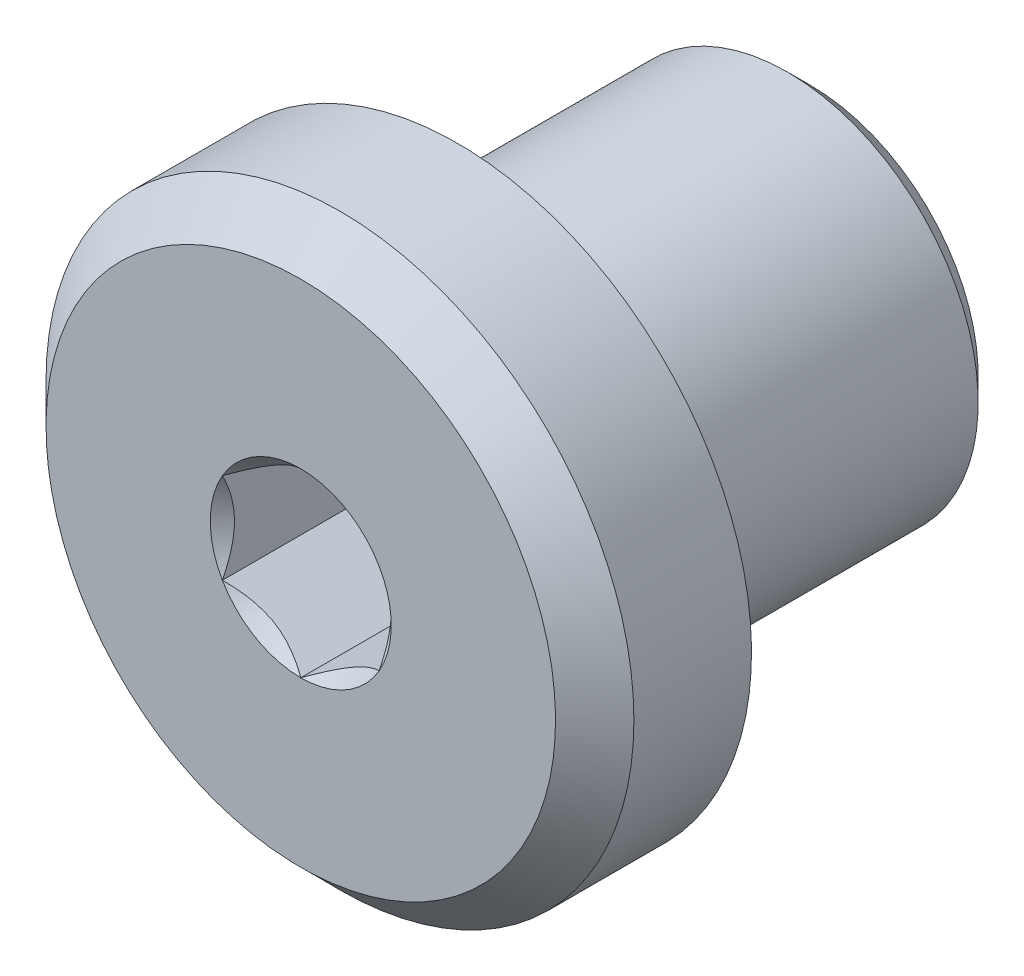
ISO-10303-21;
HEADER;
FILE_DESCRIPTION(('STEP AP214'),'2;1');
FILE_NAME('part.step','',(''),(''),'','','');
FILE_SCHEMA(('AUTOMOTIVE_DESIGN { 1 0 10303 214 1 1 1 1 }'));
ENDSEC;
DATA;
#1=APPLICATION_CONTEXT('core data for automotive mechanical design processes');
#2=APPLICATION_PROTOCOL_DEFINITION('international standard','automotive_design',2000,#1);
#3=PRODUCT_CONTEXT('',#1,'mechanical');
#4=PRODUCT('Part','Part','',(#3));
#5=PRODUCT_RELATED_PRODUCT_CATEGORY('part','',(#4));
#6=PRODUCT_DEFINITION_FORMATION('','',#4);
#7=PRODUCT_DEFINITION_CONTEXT('part definition',#1,'design');
#8=PRODUCT_DEFINITION('design','',#6,#7);
#9=PRODUCT_DEFINITION_SHAPE('','',#8);
#10=(LENGTH_UNIT() NAMED_UNIT(*) SI_UNIT(.MILLI.,.METRE.));
#11=(NAMED_UNIT(*) PLANE_ANGLE_UNIT() SI_UNIT($,.RADIAN.));
#12=(NAMED_UNIT(*) SI_UNIT($,.STERADIAN.) SOLID_ANGLE_UNIT());
#13=UNCERTAINTY_MEASURE_WITH_UNIT(LENGTH_MEASURE(1.E-05),#10,'distance_accuracy_value','');
#14=(GEOMETRIC_REPRESENTATION_CONTEXT(3) GLOBAL_UNCERTAINTY_ASSIGNED_CONTEXT((#13)) GLOBAL_UNIT_ASSIGNED_CONTEXT((#10,
#11,#12)) REPRESENTATION_CONTEXT('',''));
#15=CARTESIAN_POINT('',(0.,0.,0.));
#16=DIRECTION('',(0.,0.,1.));
#17=DIRECTION('',(1.,0.,0.));
#18=AXIS2_PLACEMENT_3D('',#15,#16,#17);
#19=CARTESIAN_POINT('',(0.,0.,-1.));
#20=DIRECTION('',(0.,0.,1.));
#21=DIRECTION('',(0.,-1.,0.));
#22=AXIS2_PLACEMENT_3D('',#19,#20,#21);
#23=PLANE('',#22);
#24=DIRECTION('',(-0.866025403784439,0.5,0.));
#25=VECTOR('',#24,1.);
#26=CARTESIAN_POINT('',(2.,1.15470053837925,-1.));
#27=LINE('',#26,#25);
#28=CARTESIAN_POINT('',(2.,1.15470053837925,-1.));
#29=VERTEX_POINT('',#28);
#30=CARTESIAN_POINT('',(0.,2.3094010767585,-1.));
#31=VERTEX_POINT('',#30);
#32=EDGE_CURVE('E64',#29,#31,#27,.T.);
#33=ORIENTED_EDGE('',*,*,#32,.T.);
#34=DIRECTION('',(-0.866025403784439,-0.5,0.));
#35=VECTOR('',#34,1.);
#36=CARTESIAN_POINT('',(0.,2.3094010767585,-1.));
#37=LINE('',#36,#35);
#38=CARTESIAN_POINT('',(-2.,1.15470053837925,-1.));
#39=VERTEX_POINT('',#38);
#40=EDGE_CURVE('E78',#31,#39,#37,.T.);
#41=ORIENTED_EDGE('',*,*,#40,.T.);
#42=DIRECTION('',(0.,-1.,0.));
#43=VECTOR('',#42,1.);
#44=CARTESIAN_POINT('',(-2.,1.15470053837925,-1.));
#45=LINE('',#44,#43);
#46=CARTESIAN_POINT('',(-2.,-1.15470053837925,-1.));
#47=VERTEX_POINT('',#46);
#48=EDGE_CURVE('E81',#39,#47,#45,.T.);
#49=ORIENTED_EDGE('',*,*,#48,.T.);
#50=DIRECTION('',(0.866025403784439,-0.5,0.));
#51=VECTOR('',#50,1.);
#52=CARTESIAN_POINT('',(-2.,-1.15470053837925,-1.));
#53=LINE('',#52,#51);
#54=CARTESIAN_POINT('',(0.,-2.3094010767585,-1.));
#55=VERTEX_POINT('',#54);
#56=EDGE_CURVE('E96',#47,#55,#53,.T.);
#57=ORIENTED_EDGE('',*,*,#56,.T.);
#58=DIRECTION('',(0.866025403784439,0.5,0.));
#59=VECTOR('',#58,1.);
#60=CARTESIAN_POINT('',(0.,-2.3094010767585,-1.));
#61=LINE('',#60,#59);
#62=CARTESIAN_POINT('',(2.,-1.15470053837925,-1.));
#63=VERTEX_POINT('',#62);
#64=EDGE_CURVE('E272',#55,#63,#61,.T.);
#65=ORIENTED_EDGE('',*,*,#64,.T.);
#66=DIRECTION('',(0.,1.,0.));
#67=VECTOR('',#66,1.);
#68=CARTESIAN_POINT('',(2.,-1.15470053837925,-1.));
#69=LINE('',#68,#67);
#70=EDGE_CURVE('E69',#63,#29,#69,.T.);
#71=ORIENTED_EDGE('',*,*,#70,.T.);
#72=EDGE_LOOP('',(#33,#41,#49,#57,#65,#71));
#73=FACE_BOUND('',#72,.T.);
#74=ADVANCED_FACE('F14',(#73),#23,.T.);
#75=CARTESIAN_POINT('',(0.,2.3094010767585,-1.));
#76=DIRECTION('',(-0.5,0.866025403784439,0.));
#77=DIRECTION('',(-0.866025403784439,-0.5,0.));
#78=AXIS2_PLACEMENT_3D('',#75,#76,#77);
#79=PLANE('',#78);
#80=ORIENTED_EDGE('',*,*,#40,.F.);
#81=DIRECTION('',(0.,0.,1.));
#82=VECTOR('',#81,1.);
#83=CARTESIAN_POINT('',(0.,2.3094010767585,-1.));
#84=LINE('',#83,#82);
#85=CARTESIAN_POINT('',(0.,2.30940107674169,4.00000000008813));
#86=VERTEX_POINT('',#85);
#87=EDGE_CURVE('E56',#31,#86,#84,.T.);
#88=ORIENTED_EDGE('',*,*,#87,.T.);
#89=CARTESIAN_POINT('',(-3.3787330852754E-11,2.30940107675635,4.00000000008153));
#90=CARTESIAN_POINT('',(-0.0687409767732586,2.26971345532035,3.96035046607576));
#91=CARTESIAN_POINT('',(-0.138631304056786,2.22936225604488,3.92303000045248));
#92=CARTESIAN_POINT('',(-0.281144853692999,2.14708201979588,3.85469782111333));
#93=CARTESIAN_POINT('',(-0.353781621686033,2.10514516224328,3.82372411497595));
#94=CARTESIAN_POINT('',(-0.500250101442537,2.02058154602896,3.7706659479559));
#95=CARTESIAN_POINT('',(-0.574044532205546,1.97797631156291,3.74844816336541));
#96=CARTESIAN_POINT('',(-0.723257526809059,1.89182814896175,3.714217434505));
#97=CARTESIAN_POINT('',(-0.798671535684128,1.84828785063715,3.70217894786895));
#98=CARTESIAN_POINT('',(-0.928651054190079,1.77324414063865,3.69131684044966));
#99=CARTESIAN_POINT('',(-0.983048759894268,1.74183761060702,3.68970938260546));
#100=CARTESIAN_POINT('',(-1.09175516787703,1.67907593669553,3.69242096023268));
#101=CARTESIAN_POINT('',(-1.14606383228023,1.64772081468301,3.69674207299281));
#102=CARTESIAN_POINT('',(-1.25416826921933,1.58530668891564,3.71106488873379));
#103=CARTESIAN_POINT('',(-1.30796339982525,1.55424805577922,3.72107294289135));
#104=CARTESIAN_POINT('',(-1.41462338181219,1.49266788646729,3.74622029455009));
#105=CARTESIAN_POINT('',(-1.46748830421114,1.46214630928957,3.76135919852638));
#106=CARTESIAN_POINT('',(-1.60286647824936,1.3839856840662,3.80629144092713));
#107=CARTESIAN_POINT('',(-1.68454116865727,1.33683077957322,3.83946797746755));
#108=CARTESIAN_POINT('',(-1.80463752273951,1.26749311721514,3.89547290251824));
#109=CARTESIAN_POINT('',(-1.84421476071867,1.2446431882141,3.91515020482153));
#110=CARTESIAN_POINT('',(-1.92263642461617,1.19936641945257,3.95629828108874));
#111=CARTESIAN_POINT('',(-1.96148128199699,1.17693933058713,3.97776795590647));
#112=CARTESIAN_POINT('',(-1.99999999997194,1.15470053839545,4.00000000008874));
#113=B_SPLINE_CURVE_WITH_KNOTS('',3,(#89,#90,#91,#92,#93,#94,#95,#96,#97,#98,#99,#100,#101,#102,
#103,#104,#105,#106,#107,#108,#109,#110,#111,#112),.UNSPECIFIED.,.F.,.F.,(4,2,2,2,2,2,2,2,2,2,2,
4),(0.,0.266365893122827,0.534283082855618,0.797946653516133,1.06094664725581,1.24918072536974,
1.43748077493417,1.62599153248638,1.81448783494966,2.11378546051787,2.26302829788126,
2.41218027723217),.UNSPECIFIED.);
#114=CARTESIAN_POINT('',(-1.99999999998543,1.15470053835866,4.00000000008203));
#115=VERTEX_POINT('',#114);
#116=EDGE_CURVE('E17',#86,#115,#113,.T.);
#117=ORIENTED_EDGE('',*,*,#116,.T.);
#118=DIRECTION('',(0.,0.,1.));
#119=VECTOR('',#118,1.);
#120=CARTESIAN_POINT('',(-2.,1.15470053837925,-1.));
#121=LINE('',#120,#119);
#122=EDGE_CURVE('E83',#115,#39,#121,.F.);
#123=ORIENTED_EDGE('',*,*,#122,.T.);
#124=EDGE_LOOP('',(#80,#88,#117,#123));
#125=FACE_BOUND('',#124,.T.);
#126=ADVANCED_FACE('F86',(#125),#79,.F.);
#127=CARTESIAN_POINT('',(-2.,1.15470053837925,-1.));
#128=DIRECTION('',(-1.,0.,0.));
#129=DIRECTION('',(0.,-1.,0.));
#130=AXIS2_PLACEMENT_3D('',#127,#128,#129);
#131=PLANE('',#130);
#132=ORIENTED_EDGE('',*,*,#48,.F.);
#133=ORIENTED_EDGE('',*,*,#122,.F.);
#134=CARTESIAN_POINT('',(-2.00000000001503,1.15470053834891,4.00000000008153));
#135=CARTESIAN_POINT('',(-2.00000000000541,1.07532529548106,3.96035046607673));
#136=CARTESIAN_POINT('',(-2.00000000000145,0.994622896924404,3.92303000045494));
#137=CARTESIAN_POINT('',(-1.99999999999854,0.830062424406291,3.85469782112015));
#138=CARTESIAN_POINT('',(-1.99999999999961,0.746188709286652,3.82372411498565));
#139=CARTESIAN_POINT('',(-2.00000000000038,0.577061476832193,3.77066594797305));
#140=CARTESIAN_POINT('',(-2.0000000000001,0.491851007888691,3.74844816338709));
#141=CARTESIAN_POINT('',(-1.9999999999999,0.319554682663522,3.7142174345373));
#142=CARTESIAN_POINT('',(-1.99999999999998,0.232474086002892,3.70217894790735));
#143=CARTESIAN_POINT('',(-2.00000000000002,0.0823866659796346,3.69131684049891));
#144=CARTESIAN_POINT('',(-2.,0.0195736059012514,3.6897093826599));
#145=CARTESIAN_POINT('',(-2.,-0.105949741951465,3.69242096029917));
#146=CARTESIAN_POINT('',(-2.,-0.168659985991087,3.69674207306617));
#147=CARTESIAN_POINT('',(-2.,-0.29348823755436,3.7110648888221));
#148=CARTESIAN_POINT('',(-2.,-0.355605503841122,3.72107294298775));
#149=CARTESIAN_POINT('',(-2.,-0.478765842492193,3.74622029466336));
#150=CARTESIAN_POINT('',(-2.,-0.539808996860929,3.76135919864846));
#151=CARTESIAN_POINT('',(-2.,-0.696130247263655,3.80629144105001));
#152=CARTESIAN_POINT('',(-2.,-0.790440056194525,3.83946797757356));
#153=CARTESIAN_POINT('',(-2.,-0.92911538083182,3.89547290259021));
#154=CARTESIAN_POINT('',(-2.,-0.974815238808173,3.91515020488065));
#155=CARTESIAN_POINT('',(-2.,-1.06536877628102,3.95629828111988));
#156=CARTESIAN_POINT('',(-2.,-1.11022295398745,3.97776795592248));
#157=CARTESIAN_POINT('',(-2.,-1.15470053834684,4.00000000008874));
#158=B_SPLINE_CURVE_WITH_KNOTS('',3,(#134,#135,#136,#137,#138,#139,#140,#141,#142,#143,#144,
#145,#146,#147,#148,#149,#150,#151,#152,#153,#154,#155,#156,#157),.UNSPECIFIED.,.F.,.F.,(4,2,2,
2,2,2,2,2,2,2,2,4),(0.,0.266365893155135,0.534283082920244,0.797946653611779,1.06094664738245,
1.24918072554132,1.43748077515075,1.62599153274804,1.81448783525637,2.11378546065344,
2.26302829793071,2.41218027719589),.UNSPECIFIED.);
#159=CARTESIAN_POINT('',(-1.99999999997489,-1.15470053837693,4.00000000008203));
#160=VERTEX_POINT('',#159);
#161=EDGE_CURVE('E204',#115,#160,#158,.T.);
#162=ORIENTED_EDGE('',*,*,#161,.T.);
#163=DIRECTION('',(0.,0.,1.));
#164=VECTOR('',#163,1.);
#165=CARTESIAN_POINT('',(-2.,-1.15470053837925,-1.));
#166=LINE('',#165,#164);
#167=EDGE_CURVE('E93',#160,#47,#166,.F.);
#168=ORIENTED_EDGE('',*,*,#167,.T.);
#169=EDGE_LOOP('',(#132,#133,#162,#168));
#170=FACE_BOUND('',#169,.T.);
#171=ADVANCED_FACE('F91',(#170),#131,.F.);
#172=CARTESIAN_POINT('',(-2.,-1.15470053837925,-1.));
#173=DIRECTION('',(-0.5,-0.866025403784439,0.));
#174=DIRECTION('',(0.866025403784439,-0.5,0.));
#175=AXIS2_PLACEMENT_3D('',#172,#173,#174);
#176=PLANE('',#175);
#177=ORIENTED_EDGE('',*,*,#56,.F.);
#178=ORIENTED_EDGE('',*,*,#167,.F.);
#179=CARTESIAN_POINT('',(-1.99999999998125,-1.15470053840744,4.00000000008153));
#180=CARTESIAN_POINT('',(-1.93125902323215,-1.19438815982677,3.96035046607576));
#181=CARTESIAN_POINT('',(-1.86136869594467,-1.23473935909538,3.92303000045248));
#182=CARTESIAN_POINT('',(-1.71885514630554,-1.31701959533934,3.85469782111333));
#183=CARTESIAN_POINT('',(-1.64621837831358,-1.3589564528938,3.82372411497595));
#184=CARTESIAN_POINT('',(-1.49974989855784,-1.44352006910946,3.7706659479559));
#185=CARTESIAN_POINT('',(-1.42595546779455,-1.48612530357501,3.74844816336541));
#186=CARTESIAN_POINT('',(-1.27674247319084,-1.57227346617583,3.714217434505));
#187=CARTESIAN_POINT('',(-1.20132846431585,-1.61581376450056,3.70217894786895));
#188=CARTESIAN_POINT('',(-1.07134894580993,-1.69085747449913,3.69131684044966));
#189=CARTESIAN_POINT('',(-1.01695124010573,-1.72226400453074,3.68970938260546));
#190=CARTESIAN_POINT('',(-0.908244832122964,-1.78502567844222,3.69242096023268));
#191=CARTESIAN_POINT('',(-0.853936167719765,-1.81638080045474,3.69674207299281));
#192=CARTESIAN_POINT('',(-0.745831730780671,-1.87879492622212,3.71106488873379));
#193=CARTESIAN_POINT('',(-0.692036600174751,-1.90985355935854,3.72107294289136));
#194=CARTESIAN_POINT('',(-0.585376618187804,-1.97143372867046,3.74622029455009));
#195=CARTESIAN_POINT('',(-0.532511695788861,-2.00195530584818,3.76135919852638));
#196=CARTESIAN_POINT('',(-0.397133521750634,-2.08011593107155,3.80629144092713));
#197=CARTESIAN_POINT('',(-0.315458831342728,-2.12727083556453,3.83946797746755));
#198=CARTESIAN_POINT('',(-0.195362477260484,-2.19660849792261,3.89547290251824));
#199=CARTESIAN_POINT('',(-0.155785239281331,-2.21945842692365,3.91515020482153));
#200=CARTESIAN_POINT('',(-0.077363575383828,-2.26473519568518,3.95629828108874));
#201=CARTESIAN_POINT('',(-0.0385187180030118,-2.28716228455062,3.97776795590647));
#202=CARTESIAN_POINT('',(-2.80654623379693E-11,-2.3094010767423,4.00000000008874));
#203=B_SPLINE_CURVE_WITH_KNOTS('',3,(#179,#180,#181,#182,#183,#184,#185,#186,#187,#188,#189,
#190,#191,#192,#193,#194,#195,#196,#197,#198,#199,#200,#201,#202),.UNSPECIFIED.,.F.,.F.,(4,2,2,
2,2,2,2,2,2,2,2,4),(0.,0.266365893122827,0.534283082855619,0.797946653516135,1.06094664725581,
1.24918072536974,1.43748077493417,1.62599153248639,1.81448783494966,2.11378546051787,
2.26302829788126,2.41218027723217),.UNSPECIFIED.);
#204=CARTESIAN_POINT('',(1.05509860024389E-11,-2.3094010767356,4.00000000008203));
#205=VERTEX_POINT('',#204);
#206=EDGE_CURVE('E184',#160,#205,#203,.T.);
#207=ORIENTED_EDGE('',*,*,#206,.T.);
#208=DIRECTION('',(0.,0.,1.));
#209=VECTOR('',#208,1.);
#210=CARTESIAN_POINT('',(0.,-2.3094010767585,-1.));
#211=LINE('',#210,#209);
#212=EDGE_CURVE('E273',#205,#55,#211,.F.);
#213=ORIENTED_EDGE('',*,*,#212,.T.);
#214=EDGE_LOOP('',(#177,#178,#207,#213));
#215=FACE_BOUND('',#214,.T.);
#216=ADVANCED_FACE('F194',(#215),#176,.F.);
#217=CARTESIAN_POINT('',(0.,-2.3094010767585,-1.));
#218=DIRECTION('',(0.5,-0.866025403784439,0.));
#219=DIRECTION('',(0.866025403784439,0.5,0.));
#220=AXIS2_PLACEMENT_3D('',#217,#218,#219);
#221=PLANE('',#220);
#222=ORIENTED_EDGE('',*,*,#64,.F.);
#223=ORIENTED_EDGE('',*,*,#212,.F.);
#224=CARTESIAN_POINT('',(3.3786816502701E-11,-2.30940107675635,4.00000000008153));
#225=CARTESIAN_POINT('',(0.0687409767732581,-2.26971345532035,3.96035046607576));
#226=CARTESIAN_POINT('',(0.138631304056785,-2.22936225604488,3.92303000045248));
#227=CARTESIAN_POINT('',(0.281144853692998,-2.14708201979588,3.85469782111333));
#228=CARTESIAN_POINT('',(0.353781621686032,-2.10514516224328,3.82372411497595));
#229=CARTESIAN_POINT('',(0.500250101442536,-2.02058154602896,3.7706659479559));
#230=CARTESIAN_POINT('',(0.574044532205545,-1.97797631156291,3.74844816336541));
#231=CARTESIAN_POINT('',(0.723257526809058,-1.89182814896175,3.714217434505));
#232=CARTESIAN_POINT('',(0.798671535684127,-1.84828785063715,3.70217894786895));
#233=CARTESIAN_POINT('',(0.928651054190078,-1.77324414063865,3.69131684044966));
#234=CARTESIAN_POINT('',(0.983048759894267,-1.74183761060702,3.68970938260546));
#235=CARTESIAN_POINT('',(1.09175516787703,-1.67907593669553,3.69242096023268));
#236=CARTESIAN_POINT('',(1.14606383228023,-1.64772081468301,3.69674207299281));
#237=CARTESIAN_POINT('',(1.25416826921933,-1.58530668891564,3.71106488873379));
#238=CARTESIAN_POINT('',(1.30796339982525,-1.55424805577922,3.72107294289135));
#239=CARTESIAN_POINT('',(1.41462338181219,-1.49266788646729,3.74622029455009));
#240=CARTESIAN_POINT('',(1.46748830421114,-1.46214630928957,3.76135919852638));
#241=CARTESIAN_POINT('',(1.60286647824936,-1.3839856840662,3.80629144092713));
#242=CARTESIAN_POINT('',(1.68454116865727,-1.33683077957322,3.83946797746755));
#243=CARTESIAN_POINT('',(1.80463752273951,-1.26749311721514,3.89547290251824));
#244=CARTESIAN_POINT('',(1.84421476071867,-1.2446431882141,3.91515020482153));
#245=CARTESIAN_POINT('',(1.92263642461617,-1.19936641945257,3.95629828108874));
#246=CARTESIAN_POINT('',(1.96148128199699,-1.17693933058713,3.97776795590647));
#247=CARTESIAN_POINT('',(1.99999999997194,-1.15470053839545,4.00000000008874));
#248=B_SPLINE_CURVE_WITH_KNOTS('',3,(#224,#225,#226,#227,#228,#229,#230,#231,#232,#233,#234,
#235,#236,#237,#238,#239,#240,#241,#242,#243,#244,#245,#246,#247),.UNSPECIFIED.,.F.,.F.,(4,2,2,
2,2,2,2,2,2,2,2,4),(0.,0.266365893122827,0.534283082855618,0.797946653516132,1.06094664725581,
1.24918072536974,1.43748077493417,1.62599153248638,1.81448783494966,2.11378546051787,
2.26302829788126,2.41218027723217),.UNSPECIFIED.);
#249=CARTESIAN_POINT('',(1.99999999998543,-1.15470053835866,4.00000000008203));
#250=VERTEX_POINT('',#249);
#251=EDGE_CURVE('E177',#205,#250,#248,.T.);
#252=ORIENTED_EDGE('',*,*,#251,.T.);
#253=DIRECTION('',(0.,0.,1.));
#254=VECTOR('',#253,1.);
#255=CARTESIAN_POINT('',(2.,-1.15470053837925,-1.));
#256=LINE('',#255,#254);
#257=EDGE_CURVE('E269',#250,#63,#256,.F.);
#258=ORIENTED_EDGE('',*,*,#257,.T.);
#259=EDGE_LOOP('',(#222,#223,#252,#258));
#260=FACE_BOUND('',#259,.T.);
#261=ADVANCED_FACE('F190',(#260),#221,.F.);
#262=CARTESIAN_POINT('',(2.,-1.15470053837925,-1.));
#263=DIRECTION('',(1.,0.,0.));
#264=DIRECTION('',(0.,1.,0.));
#265=AXIS2_PLACEMENT_3D('',#262,#263,#264);
#266=PLANE('',#265);
#267=ORIENTED_EDGE('',*,*,#70,.F.);
#268=ORIENTED_EDGE('',*,*,#257,.F.);
#269=CARTESIAN_POINT('',(2.00000000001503,-1.15470053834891,4.00000000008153));
#270=CARTESIAN_POINT('',(2.00000000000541,-1.07532529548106,3.96035046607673));
#271=CARTESIAN_POINT('',(2.00000000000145,-0.994622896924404,3.92303000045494));
#272=CARTESIAN_POINT('',(1.99999999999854,-0.830062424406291,3.85469782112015));
#273=CARTESIAN_POINT('',(1.99999999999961,-0.746188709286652,3.82372411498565));
#274=CARTESIAN_POINT('',(2.00000000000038,-0.577061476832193,3.77066594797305));
#275=CARTESIAN_POINT('',(2.0000000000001,-0.491851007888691,3.74844816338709));
#276=CARTESIAN_POINT('',(1.9999999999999,-0.319554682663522,3.7142174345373));
#277=CARTESIAN_POINT('',(1.99999999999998,-0.232474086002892,3.70217894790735));
#278=CARTESIAN_POINT('',(2.00000000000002,-0.0823866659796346,3.69131684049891));
#279=CARTESIAN_POINT('',(2.,-0.0195736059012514,3.6897093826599));
#280=CARTESIAN_POINT('',(2.,0.105949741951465,3.69242096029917));
#281=CARTESIAN_POINT('',(2.,0.168659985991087,3.69674207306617));
#282=CARTESIAN_POINT('',(2.,0.29348823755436,3.7110648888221));
#283=CARTESIAN_POINT('',(2.,0.355605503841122,3.72107294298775));
#284=CARTESIAN_POINT('',(2.,0.478765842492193,3.74622029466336));
#285=CARTESIAN_POINT('',(2.,0.539808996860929,3.76135919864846));
#286=CARTESIAN_POINT('',(2.,0.696130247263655,3.80629144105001));
#287=CARTESIAN_POINT('',(2.,0.790440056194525,3.83946797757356));
#288=CARTESIAN_POINT('',(2.,0.92911538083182,3.89547290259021));
#289=CARTESIAN_POINT('',(2.,0.974815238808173,3.91515020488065));
#290=CARTESIAN_POINT('',(2.,1.06536877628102,3.95629828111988));
#291=CARTESIAN_POINT('',(2.,1.11022295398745,3.97776795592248));
#292=CARTESIAN_POINT('',(2.,1.15470053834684,4.00000000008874));
#293=B_SPLINE_CURVE_WITH_KNOTS('',3,(#269,#270,#271,#272,#273,#274,#275,#276,#277,#278,#279,
#280,#281,#282,#283,#284,#285,#286,#287,#288,#289,#290,#291,#292),.UNSPECIFIED.,.F.,.F.,(4,2,2,
2,2,2,2,2,2,2,2,4),(0.,0.266365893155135,0.534283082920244,0.797946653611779,1.06094664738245,
1.24918072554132,1.43748077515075,1.62599153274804,1.81448783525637,2.11378546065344,
2.26302829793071,2.41218027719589),.UNSPECIFIED.);
#294=CARTESIAN_POINT('',(1.99999999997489,1.15470053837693,4.00000000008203));
#295=VERTEX_POINT('',#294);
#296=EDGE_CURVE('E37',#250,#295,#293,.T.);
#297=ORIENTED_EDGE('',*,*,#296,.T.);
#298=DIRECTION('',(0.,0.,1.));
#299=VECTOR('',#298,1.);
#300=CARTESIAN_POINT('',(2.,1.15470053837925,-1.));
#301=LINE('',#300,#299);
#302=EDGE_CURVE('E267',#295,#29,#301,.F.);
#303=ORIENTED_EDGE('',*,*,#302,.T.);
#304=EDGE_LOOP('',(#267,#268,#297,#303));
#305=FACE_BOUND('',#304,.T.);
#306=ADVANCED_FACE('F193',(#305),#266,.F.);
#307=CARTESIAN_POINT('',(2.,1.15470053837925,-1.));
#308=DIRECTION('',(0.5,0.866025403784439,0.));
#309=DIRECTION('',(-0.866025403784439,0.5,0.));
#310=AXIS2_PLACEMENT_3D('',#307,#308,#309);
#311=PLANE('',#310);
#312=ORIENTED_EDGE('',*,*,#32,.F.);
#313=ORIENTED_EDGE('',*,*,#302,.F.);
#314=CARTESIAN_POINT('',(1.99999999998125,1.15470053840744,4.00000000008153));
#315=CARTESIAN_POINT('',(1.93125902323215,1.19438815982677,3.96035046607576));
#316=CARTESIAN_POINT('',(1.86136869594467,1.23473935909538,3.92303000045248));
#317=CARTESIAN_POINT('',(1.71885514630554,1.31701959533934,3.85469782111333));
#318=CARTESIAN_POINT('',(1.64621837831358,1.3589564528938,3.82372411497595));
#319=CARTESIAN_POINT('',(1.49974989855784,1.44352006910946,3.7706659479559));
#320=CARTESIAN_POINT('',(1.42595546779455,1.48612530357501,3.74844816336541));
#321=CARTESIAN_POINT('',(1.27674247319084,1.57227346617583,3.714217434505));
#322=CARTESIAN_POINT('',(1.20132846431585,1.61581376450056,3.70217894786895));
#323=CARTESIAN_POINT('',(1.07134894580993,1.69085747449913,3.69131684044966));
#324=CARTESIAN_POINT('',(1.01695124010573,1.72226400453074,3.68970938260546));
#325=CARTESIAN_POINT('',(0.908244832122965,1.78502567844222,3.69242096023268));
#326=CARTESIAN_POINT('',(0.853936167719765,1.81638080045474,3.69674207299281));
#327=CARTESIAN_POINT('',(0.745831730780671,1.87879492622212,3.71106488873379));
#328=CARTESIAN_POINT('',(0.692036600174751,1.90985355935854,3.72107294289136));
#329=CARTESIAN_POINT('',(0.585376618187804,1.97143372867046,3.74622029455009));
#330=CARTESIAN_POINT('',(0.532511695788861,2.00195530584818,3.76135919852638));
#331=CARTESIAN_POINT('',(0.397133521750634,2.08011593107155,3.80629144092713));
#332=CARTESIAN_POINT('',(0.315458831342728,2.12727083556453,3.83946797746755));
#333=CARTESIAN_POINT('',(0.195362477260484,2.19660849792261,3.89547290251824));
#334=CARTESIAN_POINT('',(0.155785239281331,2.21945842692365,3.91515020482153));
#335=CARTESIAN_POINT('',(0.0773635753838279,2.26473519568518,3.95629828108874));
#336=CARTESIAN_POINT('',(0.0385187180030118,2.28716228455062,3.97776795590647));
#337=CARTESIAN_POINT('',(2.80652560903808E-11,2.3094010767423,4.00000000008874));
#338=B_SPLINE_CURVE_WITH_KNOTS('',3,(#314,#315,#316,#317,#318,#319,#320,#321,#322,#323,#324,
#325,#326,#327,#328,#329,#330,#331,#332,#333,#334,#335,#336,#337),.UNSPECIFIED.,.F.,.F.,(4,2,2,
2,2,2,2,2,2,2,2,4),(0.,0.266365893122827,0.534283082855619,0.797946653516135,1.06094664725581,
1.24918072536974,1.43748077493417,1.62599153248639,1.81448783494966,2.11378546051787,
2.26302829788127,2.41218027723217),.UNSPECIFIED.);
#339=EDGE_CURVE('E140',#295,#86,#338,.T.);
#340=ORIENTED_EDGE('',*,*,#339,.T.);
#341=ORIENTED_EDGE('',*,*,#87,.F.);
#342=EDGE_LOOP('',(#312,#313,#340,#341));
#343=FACE_BOUND('',#342,.T.);
#344=ADVANCED_FACE('F155',(#343),#311,.F.);
#345=CARTESIAN_POINT('',(0.,0.,4.00000000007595));
#346=DIRECTION('',(0.,0.,1.));
#347=DIRECTION('',(0.,-1.,0.));
#348=AXIS2_PLACEMENT_3D('',#345,#346,#347);
#349=CONICAL_SURFACE('',#348,2.3094010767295,0.785398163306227);
#350=ORIENTED_EDGE('',*,*,#116,.F.);
#351=CARTESIAN_POINT('',(0.,0.,4.00000000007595));
#352=DIRECTION('',(0.,0.,1.));
#353=DIRECTION('',(0.,-1.,0.));
#354=AXIS2_PLACEMENT_3D('',#351,#352,#353);
#355=CIRCLE('',#354,2.3094010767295);
#356=EDGE_CURVE('E138',#86,#115,#355,.T.);
#357=ORIENTED_EDGE('',*,*,#356,.T.);
#358=EDGE_LOOP('',(#350,#357));
#359=FACE_BOUND('',#358,.T.);
#360=ADVANCED_FACE('F212',(#359),#349,.F.);
#361=CARTESIAN_POINT('',(0.,0.,4.00000000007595));
#362=DIRECTION('',(0.,0.,1.));
#363=DIRECTION('',(0.,-1.,0.));
#364=AXIS2_PLACEMENT_3D('',#361,#362,#363);
#365=CONICAL_SURFACE('',#364,2.3094010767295,0.785398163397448);
#366=ORIENTED_EDGE('',*,*,#161,.F.);
#367=CARTESIAN_POINT('',(0.,0.,4.00000000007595));
#368=DIRECTION('',(0.,0.,1.));
#369=DIRECTION('',(0.,-1.,0.));
#370=AXIS2_PLACEMENT_3D('',#367,#368,#369);
#371=CIRCLE('',#370,2.3094010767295);
#372=EDGE_CURVE('E135',#115,#160,#371,.T.);
#373=ORIENTED_EDGE('',*,*,#372,.T.);
#374=EDGE_LOOP('',(#366,#373));
#375=FACE_BOUND('',#374,.T.);
#376=ADVANCED_FACE('F209',(#375),#365,.F.);
#377=CARTESIAN_POINT('',(0.,0.,4.00000000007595));
#378=DIRECTION('',(0.,0.,1.));
#379=DIRECTION('',(0.,-1.,0.));
#380=AXIS2_PLACEMENT_3D('',#377,#378,#379);
#381=CONICAL_SURFACE('',#380,2.3094010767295,0.785398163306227);
#382=ORIENTED_EDGE('',*,*,#206,.F.);
#383=CARTESIAN_POINT('',(0.,0.,4.00000000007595));
#384=DIRECTION('',(0.,0.,1.));
#385=DIRECTION('',(0.,-1.,0.));
#386=AXIS2_PLACEMENT_3D('',#383,#384,#385);
#387=CIRCLE('',#386,2.3094010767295);
#388=EDGE_CURVE('E132',#160,#205,#387,.T.);
#389=ORIENTED_EDGE('',*,*,#388,.T.);
#390=EDGE_LOOP('',(#382,#389));
#391=FACE_BOUND('',#390,.T.);
#392=ADVANCED_FACE('F173',(#391),#381,.F.);
#393=CARTESIAN_POINT('',(0.,0.,4.00000000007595));
#394=DIRECTION('',(0.,0.,1.));
#395=DIRECTION('',(0.,-1.,0.));
#396=AXIS2_PLACEMENT_3D('',#393,#394,#395);
#397=CONICAL_SURFACE('',#396,2.3094010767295,0.785398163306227);
#398=ORIENTED_EDGE('',*,*,#251,.F.);
#399=CARTESIAN_POINT('',(0.,0.,4.00000000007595));
#400=DIRECTION('',(0.,0.,1.));
#401=DIRECTION('',(0.,-1.,0.));
#402=AXIS2_PLACEMENT_3D('',#399,#400,#401);
#403=CIRCLE('',#402,2.3094010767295);
#404=EDGE_CURVE('E129',#205,#250,#403,.T.);
#405=ORIENTED_EDGE('',*,*,#404,.T.);
#406=EDGE_LOOP('',(#398,#405));
#407=FACE_BOUND('',#406,.T.);
#408=ADVANCED_FACE('F168',(#407),#397,.F.);
#409=CARTESIAN_POINT('',(0.,0.,4.00000000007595));
#410=DIRECTION('',(0.,0.,1.));
#411=DIRECTION('',(0.,-1.,0.));
#412=AXIS2_PLACEMENT_3D('',#409,#410,#411);
#413=CONICAL_SURFACE('',#412,2.3094010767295,0.785398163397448);
#414=ORIENTED_EDGE('',*,*,#296,.F.);
#415=CARTESIAN_POINT('',(0.,0.,4.00000000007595));
#416=DIRECTION('',(0.,0.,1.));
#417=DIRECTION('',(0.,-1.,0.));
#418=AXIS2_PLACEMENT_3D('',#415,#416,#417);
#419=CIRCLE('',#418,2.3094010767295);
#420=EDGE_CURVE('E126',#250,#295,#419,.T.);
#421=ORIENTED_EDGE('',*,*,#420,.T.);
#422=EDGE_LOOP('',(#414,#421));
#423=FACE_BOUND('',#422,.T.);
#424=ADVANCED_FACE('F162',(#423),#413,.F.);
#425=CARTESIAN_POINT('',(0.,0.,4.00000000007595));
#426=DIRECTION('',(0.,0.,1.));
#427=DIRECTION('',(0.,-1.,0.));
#428=AXIS2_PLACEMENT_3D('',#425,#426,#427);
#429=CONICAL_SURFACE('',#428,2.3094010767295,0.785398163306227);
#430=ORIENTED_EDGE('',*,*,#339,.F.);
#431=CARTESIAN_POINT('',(0.,0.,4.00000000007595));
#432=DIRECTION('',(0.,0.,1.));
#433=DIRECTION('',(0.,-1.,0.));
#434=AXIS2_PLACEMENT_3D('',#431,#432,#433);
#435=CIRCLE('',#434,2.3094010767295);
#436=EDGE_CURVE('E123',#295,#86,#435,.T.);
#437=ORIENTED_EDGE('',*,*,#436,.T.);
#438=EDGE_LOOP('',(#430,#437));
#439=FACE_BOUND('',#438,.T.);
#440=ADVANCED_FACE('F157',(#439),#429,.F.);
#441=CARTESIAN_POINT('',(2.3094010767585,0.,4.));
#442=DIRECTION('',(0.,0.,-1.));
#443=DIRECTION('',(0.,1.,0.));
#444=AXIS2_PLACEMENT_3D('',#441,#442,#443);
#445=PLANE('',#444);
#446=ORIENTED_EDGE('',*,*,#420,.F.);
#447=ORIENTED_EDGE('',*,*,#404,.F.);
#448=ORIENTED_EDGE('',*,*,#388,.F.);
#449=ORIENTED_EDGE('',*,*,#372,.F.);
#450=ORIENTED_EDGE('',*,*,#356,.F.);
#451=ORIENTED_EDGE('',*,*,#436,.F.);
#452=EDGE_LOOP('',(#446,#447,#448,#449,#450,#451));
#453=FACE_BOUND('',#452,.T.);
#454=CARTESIAN_POINT('',(0.,0.,4.0000000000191));
#455=DIRECTION('',(0.,0.,-1.));
#456=DIRECTION('',(0.,1.,0.));
#457=AXIS2_PLACEMENT_3D('',#454,#455,#456);
#458=CIRCLE('',#457,6.50000000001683);
#459=CARTESIAN_POINT('',(0.,6.50000000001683,4.0000000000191));
#460=VERTEX_POINT('',#459);
#461=EDGE_CURVE('E120',#460,#460,#458,.T.);
#462=ORIENTED_EDGE('',*,*,#461,.F.);
#463=EDGE_LOOP('',(#462));
#464=FACE_BOUND('',#463,.T.);
#465=ADVANCED_FACE('F161',(#453,#464),#445,.F.);
#466=CARTESIAN_POINT('',(0.,0.,2.99999999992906));
#467=DIRECTION('',(0.,0.,-1.));
#468=DIRECTION('',(0.,1.,0.));
#469=AXIS2_PLACEMENT_3D('',#466,#467,#468);
#470=CONICAL_SURFACE('',#469,7.50000000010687,0.785398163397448);
#471=ORIENTED_EDGE('',*,*,#461,.T.);
#472=EDGE_LOOP('',(#471));
#473=FACE_BOUND('',#472,.T.);
#474=CARTESIAN_POINT('',(0.,0.,3.));
#475=DIRECTION('',(0.,0.,1.));
#476=DIRECTION('',(0.,-1.,0.));
#477=AXIS2_PLACEMENT_3D('',#474,#475,#476);
#478=CIRCLE('',#477,7.5);
#479=CARTESIAN_POINT('',(0.,-7.5,3.));
#480=VERTEX_POINT('',#479);
#481=EDGE_CURVE('E119',#480,#480,#478,.F.);
#482=ORIENTED_EDGE('',*,*,#481,.F.);
#483=EDGE_LOOP('',(#482));
#484=FACE_BOUND('',#483,.T.);
#485=ADVANCED_FACE('F317',(#473,#484),#470,.T.);
#486=CARTESIAN_POINT('',(0.,0.,-9.));
#487=DIRECTION('',(0.,0.,1.));
#488=DIRECTION('',(0.,-1.,0.));
#489=AXIS2_PLACEMENT_3D('',#486,#487,#488);
#490=CYLINDRICAL_SURFACE('',#489,7.5);
#491=ORIENTED_EDGE('',*,*,#481,.T.);
#492=EDGE_LOOP('',(#491));
#493=FACE_BOUND('',#492,.T.);
#494=CARTESIAN_POINT('',(0.,0.,0.));
#495=DIRECTION('',(0.,0.,1.));
#496=DIRECTION('',(0.,-1.,0.));
#497=AXIS2_PLACEMENT_3D('',#494,#495,#496);
#498=CIRCLE('',#497,7.5);
#499=CARTESIAN_POINT('',(0.,-7.5,0.));
#500=VERTEX_POINT('',#499);
#501=EDGE_CURVE('E116',#500,#500,#498,.T.);
#502=ORIENTED_EDGE('',*,*,#501,.T.);
#503=EDGE_LOOP('',(#502));
#504=FACE_BOUND('',#503,.T.);
#505=ADVANCED_FACE('F323',(#493,#504),#490,.T.);
#506=CARTESIAN_POINT('',(7.5,0.,0.));
#507=DIRECTION('',(0.,0.,1.));
#508=DIRECTION('',(0.,-1.,0.));
#509=AXIS2_PLACEMENT_3D('',#506,#507,#508);
#510=PLANE('',#509);
#511=ORIENTED_EDGE('',*,*,#501,.F.);
#512=EDGE_LOOP('',(#511));
#513=FACE_BOUND('',#512,.T.);
#514=CARTESIAN_POINT('',(0.,0.,0.));
#515=DIRECTION('',(0.,0.,-1.));
#516=DIRECTION('',(0.,1.,0.));
#517=AXIS2_PLACEMENT_3D('',#514,#515,#516);
#518=CIRCLE('',#517,5.74282032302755);
#519=CARTESIAN_POINT('',(0.,5.74282032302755,0.));
#520=VERTEX_POINT('',#519);
#521=EDGE_CURVE('E113',#520,#520,#518,.T.);
#522=ORIENTED_EDGE('',*,*,#521,.F.);
#523=EDGE_LOOP('',(#522));
#524=FACE_BOUND('',#523,.T.);
#525=ADVANCED_FACE('F254',(#513,#524),#510,.F.);
#526=CARTESIAN_POINT('',(0.,0.,0.65));
#527=DIRECTION('',(0.,0.,-1.));
#528=DIRECTION('',(0.,1.,0.));
#529=AXIS2_PLACEMENT_3D('',#526,#527,#528);
#530=TOROIDAL_SURFACE('',#529,5.05,0.95);
#531=CARTESIAN_POINT('',(0.,0.,0.));
#532=DIRECTION('',(0.,0.,-1.));
#533=DIRECTION('',(0.,1.,0.));
#534=AXIS2_PLACEMENT_3D('',#531,#532,#533);
#535=CIRCLE('',#534,4.35717967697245);
#536=CARTESIAN_POINT('',(0.,4.35717967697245,0.));
#537=VERTEX_POINT('',#536);
#538=EDGE_CURVE('E110',#537,#537,#535,.F.);
#539=ORIENTED_EDGE('',*,*,#538,.T.);
#540=EDGE_LOOP('',(#539));
#541=FACE_BOUND('',#540,.T.);
#542=ORIENTED_EDGE('',*,*,#521,.T.);
#543=EDGE_LOOP('',(#542));
#544=FACE_BOUND('',#543,.T.);
#545=ADVANCED_FACE('F249',(#541,#544),#530,.T.);
#546=CARTESIAN_POINT('',(7.5,0.,0.));
#547=DIRECTION('',(0.,0.,1.));
#548=DIRECTION('',(0.,-1.,0.));
#549=AXIS2_PLACEMENT_3D('',#546,#547,#548);
#550=PLANE('',#549);
#551=ORIENTED_EDGE('',*,*,#538,.F.);
#552=EDGE_LOOP('',(#551));
#553=FACE_BOUND('',#552,.T.);
#554=CARTESIAN_POINT('',(0.,0.,0.));
#555=DIRECTION('',(0.,0.,1.));
#556=DIRECTION('',(0.,-1.,0.));
#557=AXIS2_PLACEMENT_3D('',#554,#555,#556);
#558=CIRCLE('',#557,4.1);
#559=CARTESIAN_POINT('',(0.,-4.1,0.));
#560=VERTEX_POINT('',#559);
#561=EDGE_CURVE('E107',#560,#560,#558,.F.);
#562=ORIENTED_EDGE('',*,*,#561,.F.);
#563=EDGE_LOOP('',(#562));
#564=FACE_BOUND('',#563,.T.);
#565=ADVANCED_FACE('F245',(#553,#564),#550,.F.);
#566=CARTESIAN_POINT('',(4.283,0.,-9.));
#567=DIRECTION('',(0.,0.,1.));
#568=DIRECTION('',(0.,-1.,0.));
#569=AXIS2_PLACEMENT_3D('',#566,#567,#568);
#570=PLANE('',#569);
#571=CARTESIAN_POINT('',(0.,0.,-9.00000000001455));
#572=DIRECTION('',(0.,0.,1.));
#573=DIRECTION('',(0.,-1.,0.));
#574=AXIS2_PLACEMENT_3D('',#571,#572,#573);
#575=CIRCLE('',#574,4.28299999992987);
#576=CARTESIAN_POINT('',(0.,-4.28299999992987,-9.00000000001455));
#577=VERTEX_POINT('',#576);
#578=EDGE_CURVE('E104',#577,#577,#575,.T.);
#579=ORIENTED_EDGE('',*,*,#578,.F.);
#580=EDGE_LOOP('',(#579));
#581=FACE_BOUND('',#580,.T.);
#582=ADVANCED_FACE('F241',(#581),#570,.F.);
#583=CARTESIAN_POINT('',(0.,0.,-9.));
#584=DIRECTION('',(0.,0.,1.));
#585=DIRECTION('',(0.,-1.,0.));
#586=AXIS2_PLACEMENT_3D('',#583,#584,#585);
#587=CYLINDRICAL_SURFACE('',#586,4.1);
#588=ORIENTED_EDGE('',*,*,#561,.T.);
#589=EDGE_LOOP('',(#588));
#590=FACE_BOUND('',#589,.T.);
#591=CARTESIAN_POINT('',(0.,0.,-1.7));
#592=DIRECTION('',(0.,0.,1.));
#593=DIRECTION('',(0.,-1.,0.));
#594=AXIS2_PLACEMENT_3D('',#591,#592,#593);
#595=CIRCLE('',#594,4.1);
#596=CARTESIAN_POINT('',(0.,-4.1,-1.7));
#597=VERTEX_POINT('',#596);
#598=EDGE_CURVE('E101',#597,#597,#595,.T.);
#599=ORIENTED_EDGE('',*,*,#598,.T.);
#600=EDGE_LOOP('',(#599));
#601=FACE_BOUND('',#600,.T.);
#602=ADVANCED_FACE('F237',(#590,#601),#587,.T.);
#603=CARTESIAN_POINT('',(0.,0.,-8.41900000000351));
#604=DIRECTION('',(0.,0.,1.));
#605=DIRECTION('',(0.,-1.,0.));
#606=AXIS2_PLACEMENT_3D('',#603,#604,#605);
#607=CONICAL_SURFACE('',#606,4.86399999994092,0.785398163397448);
#608=CARTESIAN_POINT('',(0.,0.,-8.419));
#609=DIRECTION('',(0.,0.,1.));
#610=DIRECTION('',(0.,-1.,0.));
#611=AXIS2_PLACEMENT_3D('',#608,#609,#610);
#612=CIRCLE('',#611,4.864);
#613=CARTESIAN_POINT('',(0.,-4.864,-8.419));
#614=VERTEX_POINT('',#613);
#615=EDGE_CURVE('E28',#614,#614,#612,.T.);
#616=ORIENTED_EDGE('',*,*,#615,.F.);
#617=EDGE_LOOP('',(#616));
#618=FACE_BOUND('',#617,.T.);
#619=ORIENTED_EDGE('',*,*,#578,.T.);
#620=EDGE_LOOP('',(#619));
#621=FACE_BOUND('',#620,.T.);
#622=ADVANCED_FACE('F230',(#618,#621),#607,.T.);
#623=CARTESIAN_POINT('',(4.1,0.,-1.7));
#624=DIRECTION('',(0.,0.,-1.));
#625=DIRECTION('',(0.,1.,0.));
#626=AXIS2_PLACEMENT_3D('',#623,#624,#625);
#627=PLANE('',#626);
#628=ORIENTED_EDGE('',*,*,#598,.F.);
#629=EDGE_LOOP('',(#628));
#630=FACE_BOUND('',#629,.T.);
#631=CARTESIAN_POINT('',(0.,0.,-1.7));
#632=DIRECTION('',(0.,0.,1.));
#633=DIRECTION('',(0.,-1.,0.));
#634=AXIS2_PLACEMENT_3D('',#631,#632,#633);
#635=CIRCLE('',#634,4.864);
#636=CARTESIAN_POINT('',(0.,-4.864,-1.7));
#637=VERTEX_POINT('',#636);
#638=EDGE_CURVE('E9',#637,#637,#635,.F.);
#639=ORIENTED_EDGE('',*,*,#638,.F.);
#640=EDGE_LOOP('',(#639));
#641=FACE_BOUND('',#640,.T.);
#642=ADVANCED_FACE('F224',(#630,#641),#627,.F.);
#643=CARTESIAN_POINT('',(0.,0.,-9.));
#644=DIRECTION('',(0.,0.,1.));
#645=DIRECTION('',(0.,-1.,0.));
#646=AXIS2_PLACEMENT_3D('',#643,#644,#645);
#647=CYLINDRICAL_SURFACE('',#646,4.864);
#648=ORIENTED_EDGE('',*,*,#638,.T.);
#649=EDGE_LOOP('',(#648));
#650=FACE_BOUND('',#649,.T.);
#651=ORIENTED_EDGE('',*,*,#615,.T.);
#652=EDGE_LOOP('',(#651));
#653=FACE_BOUND('',#652,.T.);
#654=ADVANCED_FACE('F222',(#650,#653),#647,.T.);
#655=CLOSED_SHELL('',(#74,#126,#171,#216,#261,#306,#344,#360,#376,#392,#408,#424,#440,#465,#485,
#505,#525,#545,#565,#582,#602,#622,#642,#654));
#656=MANIFOLD_SOLID_BREP('B1',#655);
#657=ADVANCED_BREP_SHAPE_REPRESENTATION('',(#18,#656),#14);
#658=SHAPE_DEFINITION_REPRESENTATION(#9,#657);
ENDSEC;
END-ISO-10303-21;
